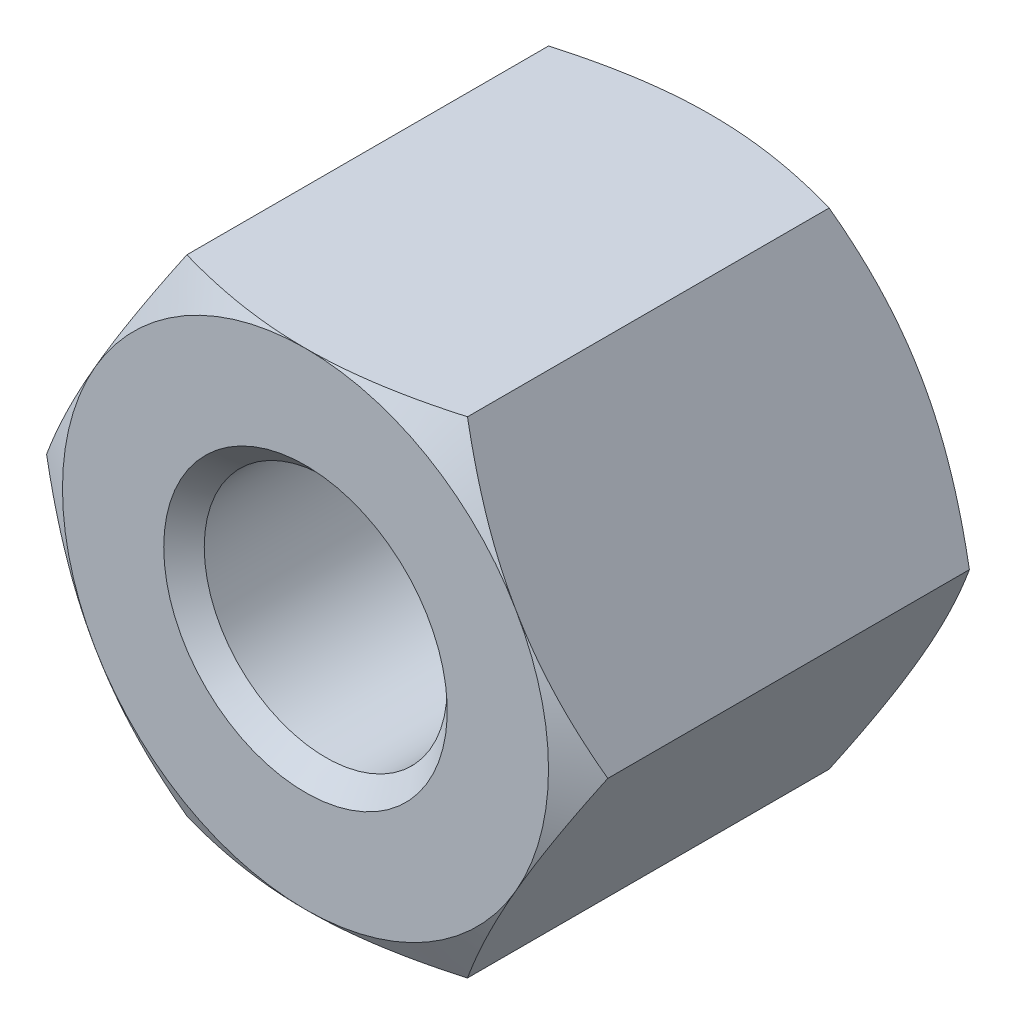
from build123d import *

# Parameters (mm, degrees)
BOSS_EXTRUDE1_DEPTH      = 2.5
SKETCH2_OUTSIDE_W        = 32.376
SKETCH2_OUTSIDE_H        = 31.448
SKETCH2_OUTSIDE_R        = 3
CUT_EXTRUDE1_DEPTH       = 6.220153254
CUT_EXTRUDE1_DRAFT       = -60
SKETCH3_R                = 1.5
SKETCH3_R_2              = 1.25
CUT_EXTRUDE2_DEPTH       = 2.5
SKETCH3_2_R              = 1.25
CUT_EXTRUDE3_DEPTH       = 3.25
CHAMFER1_SIZE            = 0.25
MIRROR1_COPY_1_SKETCH_W  = 32.376
MIRROR1_COPY_1_SKETCH_H  = 31.448
MIRROR1_COPY_1_SKETCH_R  = 3
MIRROR1_COPY_1_DEPTH     = 6.220153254
MIRROR1_COPY_1_DRAFT     = -60
CHAMFER1_OF_MIRROR1_SIZE = 0.25


with BuildPart() as part:
    # Sketch1 → Boss-Extrude1 (new body)
    with BuildSketch(Plane.XY):
        Polygon((1.732050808, 3), (-1.732050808, 3), (-3.464101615, 0), (-1.732050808, -3), (1.732050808, -3), (3.464101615, 0), align=None)
    boss_extrude1 = extrude(amount=-BOSS_EXTRUDE1_DEPTH)


with BuildPart() as cut_extrude1_tool:
    # Sketch2 outside → Cut-Extrude1 (with draft: the straight prism first)
    with BuildSketch(Plane(origin=(0, 0, -2.5), x_dir=(-1, 0, 0), z_dir=(0, 0, -1))):
        Rectangle(SKETCH2_OUTSIDE_W, SKETCH2_OUTSIDE_H)
        Circle(SKETCH2_OUTSIDE_R, mode=Mode.SUBTRACT)
    extrude(amount=-CUT_EXTRUDE1_DEPTH)
    # Cut-Extrude1: the draft: its side faces are tilted about the plane it starts from
    cut_extrude1_sides = [cut_extrude1_tool.faces().sort_by_distance(p)[0] for p in [
        (0, -15.724, 0.610076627),
        (-16.188, 0, 0.610076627),
        (0, 15.724, 0.610076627),
        (16.188, 0, 0.610076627),
        (3, 0, 0.610076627),
    ]]
    draft(cut_extrude1_sides, Plane(origin=(0, 0, -2.5), x_dir=(-1, 0, 0), z_dir=(0, 0, -1)), CUT_EXTRUDE1_DRAFT)


with BuildPart() as part_1:
    add(part.part)

    # Cut-Extrude1: cut by cut_extrude1_tool
    add(cut_extrude1_tool.part, mode=Mode.SUBTRACT)

    # Sketch3 → Cut-Extrude2 (cut)
    with BuildSketch(Plane(origin=(0, 0, -2.5), x_dir=(-1, 0, 0), z_dir=(0, 0, -1))):
        Circle(SKETCH3_R)
        Circle(SKETCH3_R_2, mode=Mode.SUBTRACT)
    cut_extrude2 = extrude(amount=-CUT_EXTRUDE2_DEPTH, mode=Mode.SUBTRACT)


with BuildPart() as cut_extrude2_piece_1:
    # of the separate pieces the step leaves, piece 1, a body of its own (cut_extrude2_pieces)
    add(part_1.part.solids().sort_by_distance((1.732050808, 3, 0))[0])

    # Chamfer1
    chamfer1_edges = [cut_extrude2_piece_1.edges().sort_by_distance(p)[0] for p in [
        (1.5, 0, -2.5),
    ]]
    chamfer(chamfer1_edges, length=CHAMFER1_SIZE)


with BuildPart() as cut_extrude2_piece_2:
    # of the separate pieces the step leaves, piece 2, a body of its own (cut_extrude2_pieces)
    add(part_1.part.solids().sort_by_distance((-1.25, 0, 0))[0])

    # Sketch3_2 → Cut-Extrude3 (cut)
    with BuildSketch(Plane(origin=(0, 0, -2.5), x_dir=(-1, 0, 0), z_dir=(0, 0, -1))):
        Circle(SKETCH3_2_R)
    cut_extrude3 = extrude(amount=-CUT_EXTRUDE3_DEPTH, mode=Mode.SUBTRACT)


with BuildPart() as cut_extrude2_piece_1_1:
    add(cut_extrude2_piece_1.part)

    # Mirror1: Boss-Extrude1, Cut-Extrude2, Cut-Extrude3 across plane
    add(boss_extrude1.mirror(Plane.XY))
    add(cut_extrude2.mirror(Plane.XY), mode=Mode.SUBTRACT)
    add(cut_extrude3.mirror(Plane.XY), mode=Mode.SUBTRACT)


with BuildPart() as mirror1_copy_1_tool:
    # Mirror1 copy 1 sketch → Mirror1 copy 1 (with draft: the straight prism first)
    with BuildSketch(Plane(origin=(0, 0, 2.5), x_dir=(-1, 0, 0), z_dir=(0, 0, 1))):
        Rectangle(MIRROR1_COPY_1_SKETCH_W, MIRROR1_COPY_1_SKETCH_H)
        Circle(MIRROR1_COPY_1_SKETCH_R, mode=Mode.SUBTRACT)
    extrude(amount=-MIRROR1_COPY_1_DEPTH)
    # Mirror1 copy 1: the draft: its side faces are tilted about the plane it starts from
    mirror1_copy_1_sides = [mirror1_copy_1_tool.faces().sort_by_distance(p)[0] for p in [
        (0, -15.724, -0.610076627),
        (-16.188, 0, -0.610076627),
        (0, 15.724, -0.610076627),
        (16.188, 0, -0.610076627),
        (3, 0, -0.610076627),
    ]]
    draft(mirror1_copy_1_sides, Plane(origin=(0, 0, 2.5), x_dir=(-1, 0, 0), z_dir=(0, 0, 1)), MIRROR1_COPY_1_DRAFT)


with BuildPart() as cut_extrude2_piece_1_2:
    add(cut_extrude2_piece_1_1.part)

    # Mirror1 copy 1: cut by mirror1_copy_1_tool
    add(mirror1_copy_1_tool.part, mode=Mode.SUBTRACT)

    # Chamfer1 of Mirror1
    chamfer1_of_mirror1_edges = [cut_extrude2_piece_1_2.edges().sort_by_distance(p)[0] for p in [
        (1.5, 0, 2.5),
    ]]
    chamfer(chamfer1_of_mirror1_edges, length=CHAMFER1_OF_MIRROR1_SIZE)


solid = cut_extrude2_piece_1_2.part
